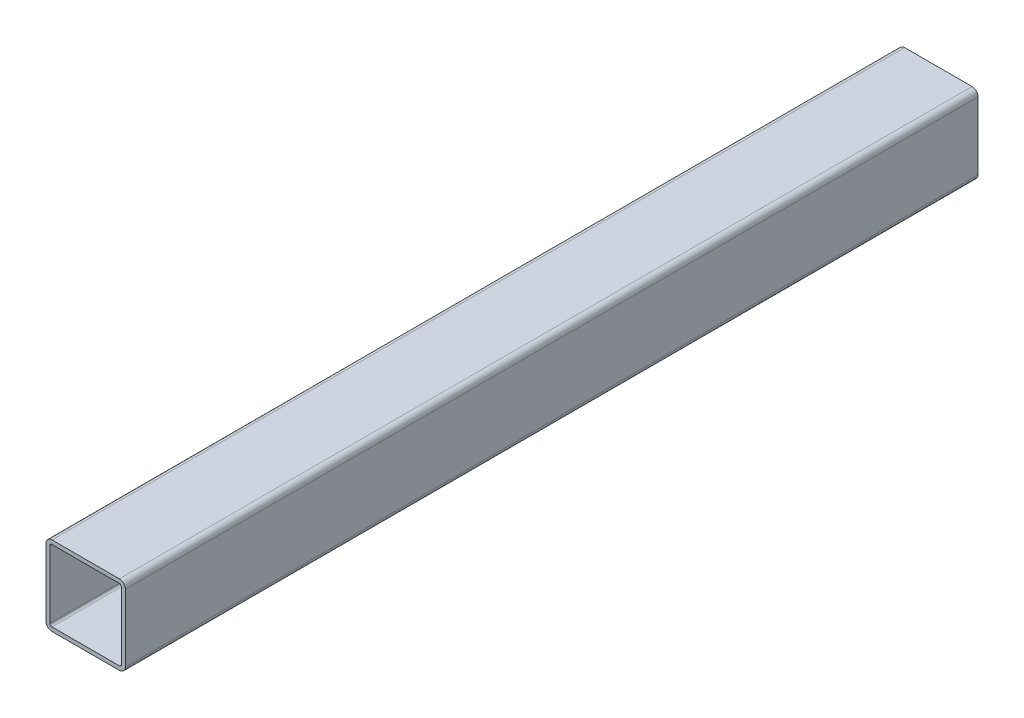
from build123d import *

# Parameters (mm, degrees)
EXTRUSION1_DEPTH = 430


with BuildPart() as part:
    # Esquisse1 → Extrusion1 (new body)
    with BuildSketch(Plane.XY):
        with BuildLine():
            Line((3, 0), (37, 0))
            ThreePointArc((37, 0), (39.121320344, 0.878679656), (40, 3))
            Line((40, 3), (40, 37))
            ThreePointArc((40, 37), (39.121320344, 39.121320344), (37, 40))
            Line((37, 40), (3, 40))
            ThreePointArc((3, 40), (0.878679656, 39.121320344), (0, 37))
            Line((0, 37), (0, 3))
            ThreePointArc((0, 3), (0.878679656, 0.878679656), (3, 0))
        make_face()
        with BuildLine():
            Line((3, 2), (37, 2))
            ThreePointArc((37, 2), (37.707106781, 2.292893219), (38, 3))
            Line((38, 3), (38, 37))
            ThreePointArc((38, 37), (37.707106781, 37.707106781), (37, 38))
            Line((37, 38), (3, 38))
            ThreePointArc((3, 38), (2.292893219, 37.707106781), (2, 37))
            Line((2, 37), (2, 3))
            ThreePointArc((2, 3), (2.292893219, 2.292893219), (3, 2))
        make_face(mode=Mode.SUBTRACT)
    extrude(amount=EXTRUSION1_DEPTH)


solid = part.part
